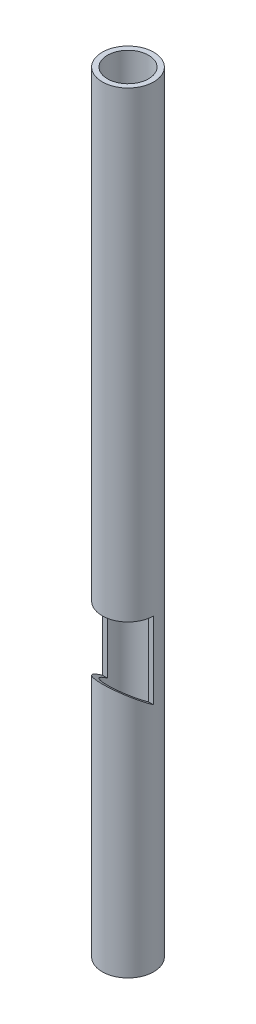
ISO-10303-21;
HEADER;
FILE_DESCRIPTION(('STEP AP214'),'2;1');
FILE_NAME('part.step','',(''),(''),'','','');
FILE_SCHEMA(('AUTOMOTIVE_DESIGN { 1 0 10303 214 1 1 1 1 }'));
ENDSEC;
DATA;
#1=APPLICATION_CONTEXT('core data for automotive mechanical design processes');
#2=APPLICATION_PROTOCOL_DEFINITION('international standard','automotive_design',2000,#1);
#3=PRODUCT_CONTEXT('',#1,'mechanical');
#4=PRODUCT('Part','Part','',(#3));
#5=PRODUCT_RELATED_PRODUCT_CATEGORY('part','',(#4));
#6=PRODUCT_DEFINITION_FORMATION('','',#4);
#7=PRODUCT_DEFINITION_CONTEXT('part definition',#1,'design');
#8=PRODUCT_DEFINITION('design','',#6,#7);
#9=PRODUCT_DEFINITION_SHAPE('','',#8);
#10=(LENGTH_UNIT() NAMED_UNIT(*) SI_UNIT(.MILLI.,.METRE.));
#11=(NAMED_UNIT(*) PLANE_ANGLE_UNIT() SI_UNIT($,.RADIAN.));
#12=(NAMED_UNIT(*) SI_UNIT($,.STERADIAN.) SOLID_ANGLE_UNIT());
#13=UNCERTAINTY_MEASURE_WITH_UNIT(LENGTH_MEASURE(1.E-05),#10,'distance_accuracy_value','');
#14=(GEOMETRIC_REPRESENTATION_CONTEXT(3) GLOBAL_UNCERTAINTY_ASSIGNED_CONTEXT((#13)) GLOBAL_UNIT_ASSIGNED_CONTEXT((#10,
#11,#12)) REPRESENTATION_CONTEXT('',''));
#15=CARTESIAN_POINT('',(0.,0.,0.));
#16=DIRECTION('',(0.,0.,1.));
#17=DIRECTION('',(1.,0.,0.));
#18=AXIS2_PLACEMENT_3D('',#15,#16,#17);
#19=CARTESIAN_POINT('',(0.,500.,0.));
#20=DIRECTION('',(0.,1.,0.));
#21=DIRECTION('',(0.,0.,1.));
#22=AXIS2_PLACEMENT_3D('',#19,#20,#21);
#23=PLANE('',#22);
#24=CARTESIAN_POINT('',(0.,500.,0.));
#25=DIRECTION('',(0.,1.,0.));
#26=DIRECTION('',(0.,0.,1.));
#27=AXIS2_PLACEMENT_3D('',#24,#25,#26);
#28=CIRCLE('',#27,16.7);
#29=CARTESIAN_POINT('',(0.,500.,16.7));
#30=VERTEX_POINT('',#29);
#31=EDGE_CURVE('E101',#30,#30,#28,.T.);
#32=ORIENTED_EDGE('',*,*,#31,.T.);
#33=EDGE_LOOP('',(#32));
#34=FACE_BOUND('',#33,.T.);
#35=CARTESIAN_POINT('',(0.,500.,0.));
#36=DIRECTION('',(0.,1.,0.));
#37=DIRECTION('',(0.,0.,1.));
#38=AXIS2_PLACEMENT_3D('',#35,#36,#37);
#39=CIRCLE('',#38,13.32);
#40=CARTESIAN_POINT('',(0.,500.,13.32));
#41=VERTEX_POINT('',#40);
#42=EDGE_CURVE('E95',#41,#41,#39,.T.);
#43=ORIENTED_EDGE('',*,*,#42,.F.);
#44=EDGE_LOOP('',(#43));
#45=FACE_BOUND('',#44,.T.);
#46=ADVANCED_FACE('F27',(#34,#45),#23,.T.);
#47=CARTESIAN_POINT('',(0.,0.,0.));
#48=DIRECTION('',(0.,1.,0.));
#49=DIRECTION('',(0.,0.,1.));
#50=AXIS2_PLACEMENT_3D('',#47,#48,#49);
#51=PLANE('',#50);
#52=CARTESIAN_POINT('',(0.,0.,0.));
#53=DIRECTION('',(0.,1.,0.));
#54=DIRECTION('',(0.,0.,1.));
#55=AXIS2_PLACEMENT_3D('',#52,#53,#54);
#56=CIRCLE('',#55,16.7);
#57=CARTESIAN_POINT('',(0.,0.,16.7));
#58=VERTEX_POINT('',#57);
#59=EDGE_CURVE('E98',#58,#58,#56,.T.);
#60=ORIENTED_EDGE('',*,*,#59,.F.);
#61=EDGE_LOOP('',(#60));
#62=FACE_BOUND('',#61,.T.);
#63=CARTESIAN_POINT('',(0.,0.,0.));
#64=DIRECTION('',(0.,1.,0.));
#65=DIRECTION('',(0.,0.,1.));
#66=AXIS2_PLACEMENT_3D('',#63,#64,#65);
#67=CIRCLE('',#66,13.32);
#68=CARTESIAN_POINT('',(0.,0.,13.32));
#69=VERTEX_POINT('',#68);
#70=EDGE_CURVE('E90',#69,#69,#67,.T.);
#71=ORIENTED_EDGE('',*,*,#70,.T.);
#72=EDGE_LOOP('',(#71));
#73=FACE_BOUND('',#72,.T.);
#74=ADVANCED_FACE('F122',(#62,#73),#51,.F.);
#75=CARTESIAN_POINT('',(0.,500.,0.));
#76=DIRECTION('',(0.,-1.,0.));
#77=DIRECTION('',(0.,0.,-1.));
#78=AXIS2_PLACEMENT_3D('',#75,#76,#77);
#79=CYLINDRICAL_SURFACE('',#78,16.7);
#80=DIRECTION('',(0.,-1.,0.));
#81=VECTOR('',#80,1.);
#82=CARTESIAN_POINT('',(16.7,500.,0.));
#83=LINE('',#82,#81);
#84=CARTESIAN_POINT('',(16.7,200.,0.));
#85=VERTEX_POINT('',#84);
#86=CARTESIAN_POINT('',(16.7,150.,0.));
#87=VERTEX_POINT('',#86);
#88=EDGE_CURVE('E42',#85,#87,#83,.T.);
#89=ORIENTED_EDGE('',*,*,#88,.T.);
#90=CARTESIAN_POINT('',(0.,150.,0.));
#91=DIRECTION('',(0.,-0.819152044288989,0.57357643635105));
#92=DIRECTION('',(0.,-0.57357643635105,-0.819152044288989));
#93=AXIS2_PLACEMENT_3D('',#90,#91,#92);
#94=ELLIPSE('',#93,20.3869356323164,16.7);
#95=CARTESIAN_POINT('',(-16.7,150.,0.));
#96=VERTEX_POINT('',#95);
#97=EDGE_CURVE('E73',#96,#87,#94,.F.);
#98=ORIENTED_EDGE('',*,*,#97,.F.);
#99=DIRECTION('',(0.,-1.,0.));
#100=VECTOR('',#99,1.);
#101=CARTESIAN_POINT('',(-16.7,500.,0.));
#102=LINE('',#101,#100);
#103=CARTESIAN_POINT('',(-16.7,200.,0.));
#104=VERTEX_POINT('',#103);
#105=EDGE_CURVE('E81',#104,#96,#102,.T.);
#106=ORIENTED_EDGE('',*,*,#105,.F.);
#107=CARTESIAN_POINT('',(0.,200.,0.));
#108=DIRECTION('',(0.,1.,0.));
#109=DIRECTION('',(0.,0.,1.));
#110=AXIS2_PLACEMENT_3D('',#107,#108,#109);
#111=CIRCLE('',#110,16.7);
#112=EDGE_CURVE('E85',#85,#104,#111,.F.);
#113=ORIENTED_EDGE('',*,*,#112,.F.);
#114=EDGE_LOOP('',(#89,#98,#106,#113));
#115=FACE_BOUND('',#114,.T.);
#116=ORIENTED_EDGE('',*,*,#31,.F.);
#117=EDGE_LOOP('',(#116));
#118=FACE_BOUND('',#117,.T.);
#119=ORIENTED_EDGE('',*,*,#59,.T.);
#120=EDGE_LOOP('',(#119));
#121=FACE_BOUND('',#120,.T.);
#122=ADVANCED_FACE('F29',(#115,#118,#121),#79,.T.);
#123=CARTESIAN_POINT('',(0.,500.,0.));
#124=DIRECTION('',(0.,-1.,0.));
#125=DIRECTION('',(0.,0.,-1.));
#126=AXIS2_PLACEMENT_3D('',#123,#124,#125);
#127=CYLINDRICAL_SURFACE('',#126,13.32);
#128=CARTESIAN_POINT('',(0.,150.,0.));
#129=DIRECTION('',(0.,-0.819152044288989,0.57357643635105));
#130=DIRECTION('',(0.,-0.57357643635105,-0.819152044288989));
#131=AXIS2_PLACEMENT_3D('',#128,#129,#130);
#132=ELLIPSE('',#131,16.2607175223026,13.32);
#133=CARTESIAN_POINT('',(13.32,150.,0.));
#134=VERTEX_POINT('',#133);
#135=CARTESIAN_POINT('',(-13.32,150.,0.));
#136=VERTEX_POINT('',#135);
#137=EDGE_CURVE('E11',#134,#136,#132,.T.);
#138=ORIENTED_EDGE('',*,*,#137,.F.);
#139=DIRECTION('',(0.,-1.,0.));
#140=VECTOR('',#139,1.);
#141=CARTESIAN_POINT('',(13.32,500.,0.));
#142=LINE('',#141,#140);
#143=CARTESIAN_POINT('',(13.32,200.,0.));
#144=VERTEX_POINT('',#143);
#145=EDGE_CURVE('E35',#144,#134,#142,.T.);
#146=ORIENTED_EDGE('',*,*,#145,.F.);
#147=CARTESIAN_POINT('',(0.,200.,0.));
#148=DIRECTION('',(0.,1.,0.));
#149=DIRECTION('',(0.,0.,1.));
#150=AXIS2_PLACEMENT_3D('',#147,#148,#149);
#151=CIRCLE('',#150,13.32);
#152=CARTESIAN_POINT('',(-13.32,200.,0.));
#153=VERTEX_POINT('',#152);
#154=EDGE_CURVE('E104',#153,#144,#151,.T.);
#155=ORIENTED_EDGE('',*,*,#154,.F.);
#156=DIRECTION('',(0.,-1.,0.));
#157=VECTOR('',#156,1.);
#158=CARTESIAN_POINT('',(-13.32,500.,0.));
#159=LINE('',#158,#157);
#160=EDGE_CURVE('E106',#136,#153,#159,.F.);
#161=ORIENTED_EDGE('',*,*,#160,.F.);
#162=EDGE_LOOP('',(#138,#146,#155,#161));
#163=FACE_BOUND('',#162,.T.);
#164=ORIENTED_EDGE('',*,*,#42,.T.);
#165=EDGE_LOOP('',(#164));
#166=FACE_BOUND('',#165,.T.);
#167=ORIENTED_EDGE('',*,*,#70,.F.);
#168=EDGE_LOOP('',(#167));
#169=FACE_BOUND('',#168,.T.);
#170=ADVANCED_FACE('F112',(#163,#166,#169),#127,.F.);
#171=CARTESIAN_POINT('',(-56.3816459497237,200.,0.));
#172=DIRECTION('',(0.,0.,-1.));
#173=DIRECTION('',(0.,1.,0.));
#174=AXIS2_PLACEMENT_3D('',#171,#172,#173);
#175=PLANE('',#174);
#176=ORIENTED_EDGE('',*,*,#145,.T.);
#177=DIRECTION('',(1.,0.,0.));
#178=VECTOR('',#177,1.);
#179=CARTESIAN_POINT('',(-56.3816459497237,150.,0.));
#180=LINE('',#179,#178);
#181=EDGE_CURVE('E66',#134,#87,#180,.T.);
#182=ORIENTED_EDGE('',*,*,#181,.T.);
#183=ORIENTED_EDGE('',*,*,#88,.F.);
#184=DIRECTION('',(1.,0.,0.));
#185=VECTOR('',#184,1.);
#186=CARTESIAN_POINT('',(-56.3816459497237,200.,0.));
#187=LINE('',#186,#185);
#188=EDGE_CURVE('E91',#144,#85,#187,.T.);
#189=ORIENTED_EDGE('',*,*,#188,.F.);
#190=EDGE_LOOP('',(#176,#182,#183,#189));
#191=FACE_BOUND('',#190,.T.);
#192=ADVANCED_FACE('F68',(#191),#175,.F.);
#193=CARTESIAN_POINT('',(-56.3816459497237,150.,0.));
#194=DIRECTION('',(0.,-0.819152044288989,0.57357643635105));
#195=DIRECTION('',(0.,-0.57357643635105,-0.819152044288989));
#196=AXIS2_PLACEMENT_3D('',#193,#194,#195);
#197=PLANE('',#196);
#198=ORIENTED_EDGE('',*,*,#137,.T.);
#199=EDGE_CURVE('E72',#96,#136,#180,.T.);
#200=ORIENTED_EDGE('',*,*,#199,.F.);
#201=ORIENTED_EDGE('',*,*,#97,.T.);
#202=ORIENTED_EDGE('',*,*,#181,.F.);
#203=EDGE_LOOP('',(#198,#200,#201,#202));
#204=FACE_BOUND('',#203,.T.);
#205=ADVANCED_FACE('F76',(#204),#197,.F.);
#206=ORIENTED_EDGE('',*,*,#160,.T.);
#207=EDGE_CURVE('E50',#104,#153,#187,.T.);
#208=ORIENTED_EDGE('',*,*,#207,.F.);
#209=ORIENTED_EDGE('',*,*,#105,.T.);
#210=ORIENTED_EDGE('',*,*,#199,.T.);
#211=EDGE_LOOP('',(#206,#208,#209,#210));
#212=FACE_BOUND('',#211,.T.);
#213=ADVANCED_FACE('F110',(#212),#175,.F.);
#214=CARTESIAN_POINT('',(-56.3816459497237,200.,20.));
#215=DIRECTION('',(0.,1.,0.));
#216=DIRECTION('',(0.,0.,1.));
#217=AXIS2_PLACEMENT_3D('',#214,#215,#216);
#218=PLANE('',#217);
#219=ORIENTED_EDGE('',*,*,#154,.T.);
#220=ORIENTED_EDGE('',*,*,#188,.T.);
#221=ORIENTED_EDGE('',*,*,#112,.T.);
#222=ORIENTED_EDGE('',*,*,#207,.T.);
#223=EDGE_LOOP('',(#219,#220,#221,#222));
#224=FACE_BOUND('',#223,.T.);
#225=ADVANCED_FACE('F114',(#224),#218,.F.);
#226=CLOSED_SHELL('',(#46,#74,#122,#170,#192,#205,#213,#225));
#227=MANIFOLD_SOLID_BREP('B2',#226);
#228=ADVANCED_BREP_SHAPE_REPRESENTATION('',(#18,#227),#14);
#229=SHAPE_DEFINITION_REPRESENTATION(#9,#228);
ENDSEC;
END-ISO-10303-21;
